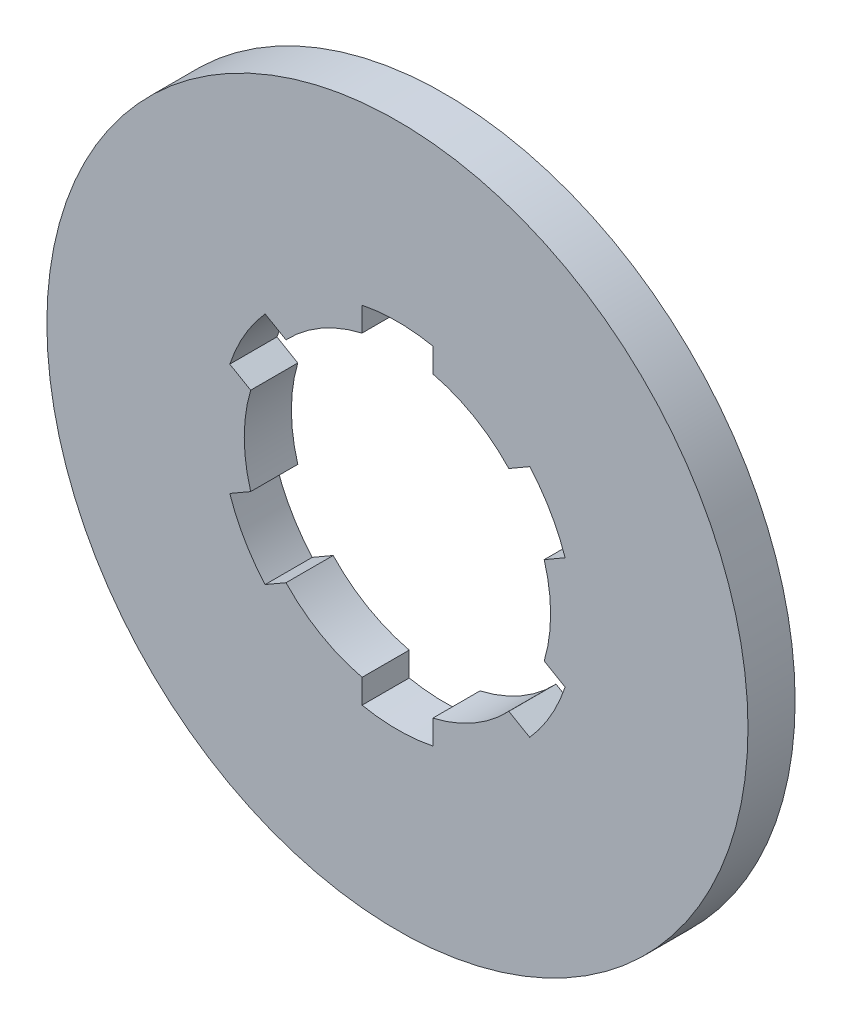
from build123d import *

# Parameters (mm, degrees)
ESQUISSE1_R                  = 29.75
BASE_EXTRUSION_DEPTH         = 2
ESQUISSE3_R                  = 13
ENL_V_MAT_EXTRU_1_DEPTH      = 43.262572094
ENL_V_MAT_EXTRU_2_DEPTH      = 58.715339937
R_P_TITION_CIRCULAIRE1_COUNT = 6


with BuildPart() as part:
    # Esquisse1 → Base-Extrusion (new, symmetric)
    with BuildSketch(Plane.XY):
        Circle(ESQUISSE1_R)
    extrude(amount=BASE_EXTRUSION_DEPTH, both=True)

    # Esquisse3 → Enl_v. mat.-Extru.1 (cut, through all)
    with BuildSketch(Plane.XY.offset(2)):
        Circle(ESQUISSE3_R)
    extrude(amount=-ENL_V_MAT_EXTRU_1_DEPTH, mode=Mode.SUBTRACT)

    # Esquisse2 → Enl_v. mat.-Extru.2 (cut, through all)
    with BuildSketch(Plane(origin=(-14.376705, -7.235056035, 2), x_dir=(1, 0, 0), z_dir=(0, 0, 1))):
        with BuildLine():
            Line((11.376705, 21.931994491), (11.376705, 19.884166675))
            ThreePointArc((11.376705, 19.884166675), (14.376705, 20.235056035), (17.376705, 19.884166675))
            Line((17.376705, 19.884166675), (17.376705, 21.931994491))
            ThreePointArc((17.376705, 21.931994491), (14.376705, 22.235056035), (11.376705, 21.931994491))
        make_face()
    enl_v_mat_extru_2 = extrude(amount=-ENL_V_MAT_EXTRU_2_DEPTH, mode=Mode.SUBTRACT)

    # R_p_tition circulaire1: Enl_v. mat.-Extru.2 ×6 about axis
    r_p_tition_circulaire1_axis = Axis((0, 0, 0), (0, 0, 1))
    for i in range(1, R_P_TITION_CIRCULAIRE1_COUNT):
        add(enl_v_mat_extru_2.rotate(r_p_tition_circulaire1_axis, i * 360 / R_P_TITION_CIRCULAIRE1_COUNT), mode=Mode.SUBTRACT)


solid = part.part
